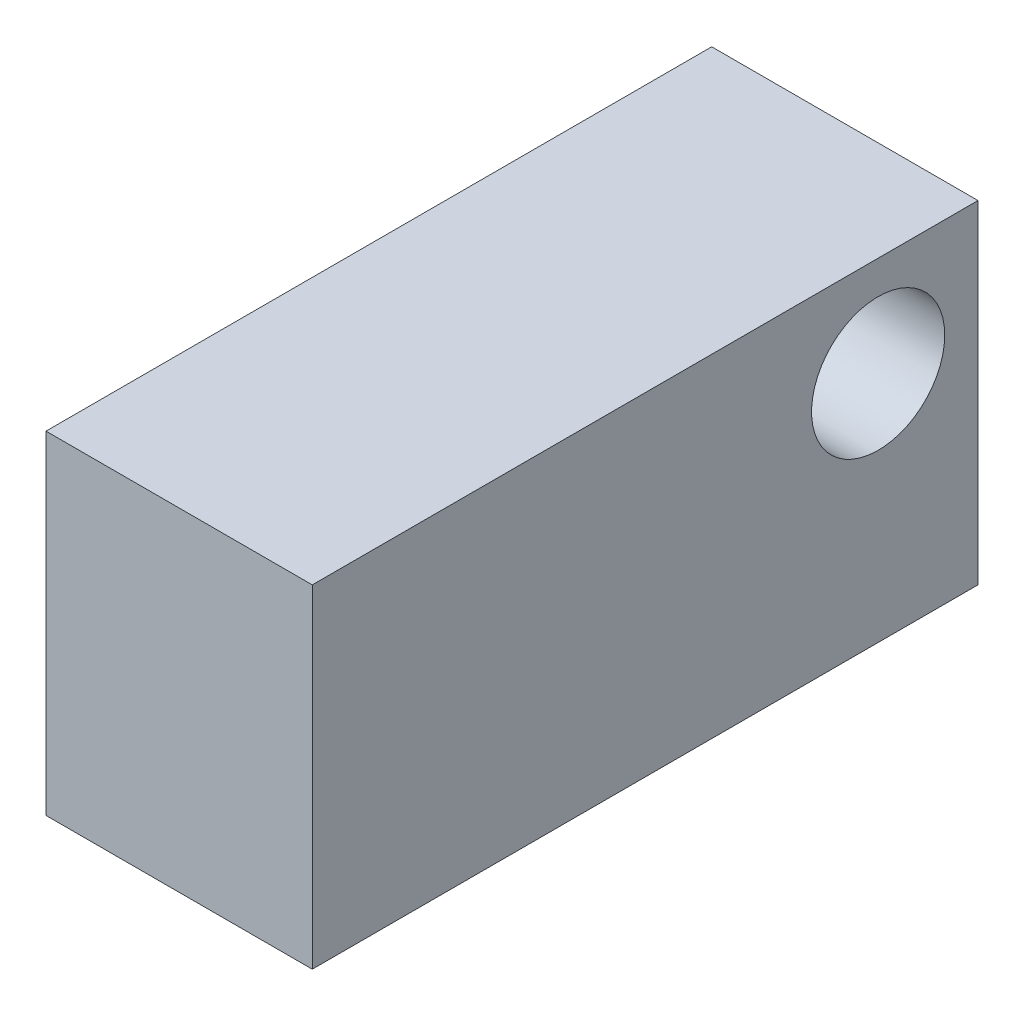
from build123d import *

# Parameters (mm, degrees)
SKIZZE1_W                       = 100
SKIZZE1_H                       = 50
AUFSATZ_LINEAR_AUSTRAGEN1_DEPTH = 40
SKIZZE2_R                       = 10
SCHNITT_LINEAR_AUSTRAGEN1_DEPTH = 40


with BuildPart() as part:
    # Skizze1 → Aufsatz-Linear austragen1 (new body)
    with BuildSketch(Plane(origin=(0, 0, 0), x_dir=(0, 0, -1), z_dir=(1, 0, 0))):
        with Locations((-70, -125)):
            Rectangle(SKIZZE1_W, SKIZZE1_H)
    extrude(amount=-AUFSATZ_LINEAR_AUSTRAGEN1_DEPTH)

    # Skizze2 → Schnitt-Linear austragen1 (cut)
    with BuildSketch(Plane(origin=(0, 0, 0), x_dir=(0, 0, -1), z_dir=(1, 0, 0))):
        with Locations((-35, -115)):
            Circle(SKIZZE2_R)
    extrude(amount=-SCHNITT_LINEAR_AUSTRAGEN1_DEPTH, mode=Mode.SUBTRACT)


solid = part.part
